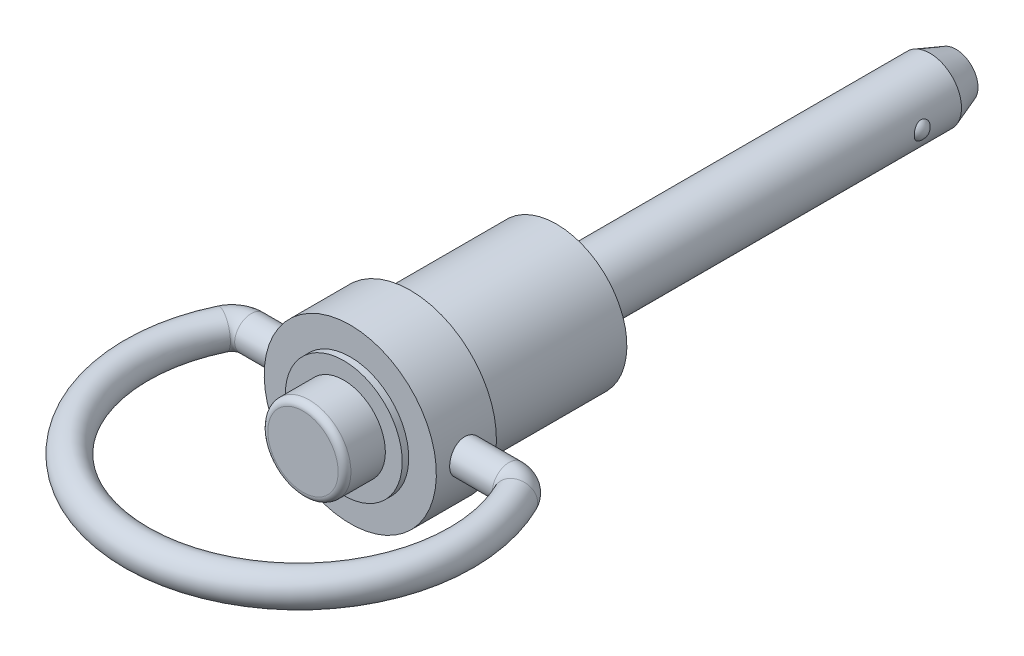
ISO-10303-21;
HEADER;
FILE_DESCRIPTION(('STEP AP214'),'2;1');
FILE_NAME('part.step','',(''),(''),'','','');
FILE_SCHEMA(('AUTOMOTIVE_DESIGN { 1 0 10303 214 1 1 1 1 }'));
ENDSEC;
DATA;
#1=APPLICATION_CONTEXT('core data for automotive mechanical design processes');
#2=APPLICATION_PROTOCOL_DEFINITION('international standard','automotive_design',2000,#1);
#3=PRODUCT_CONTEXT('',#1,'mechanical');
#4=PRODUCT('Part','Part','',(#3));
#5=PRODUCT_RELATED_PRODUCT_CATEGORY('part','',(#4));
#6=PRODUCT_DEFINITION_FORMATION('','',#4);
#7=PRODUCT_DEFINITION_CONTEXT('part definition',#1,'design');
#8=PRODUCT_DEFINITION('design','',#6,#7);
#9=PRODUCT_DEFINITION_SHAPE('','',#8);
#10=(LENGTH_UNIT() NAMED_UNIT(*) SI_UNIT(.MILLI.,.METRE.));
#11=(NAMED_UNIT(*) PLANE_ANGLE_UNIT() SI_UNIT($,.RADIAN.));
#12=(NAMED_UNIT(*) SI_UNIT($,.STERADIAN.) SOLID_ANGLE_UNIT());
#13=UNCERTAINTY_MEASURE_WITH_UNIT(LENGTH_MEASURE(1.E-05),#10,'distance_accuracy_value','');
#14=(GEOMETRIC_REPRESENTATION_CONTEXT(3) GLOBAL_UNCERTAINTY_ASSIGNED_CONTEXT((#13)) GLOBAL_UNIT_ASSIGNED_CONTEXT((#10,
#11,#12)) REPRESENTATION_CONTEXT('',''));
#15=CARTESIAN_POINT('',(0.,0.,0.));
#16=DIRECTION('',(0.,0.,1.));
#17=DIRECTION('',(1.,0.,0.));
#18=AXIS2_PLACEMENT_3D('',#15,#16,#17);
#19=CARTESIAN_POINT('',(0.,0.,20.828));
#20=DIRECTION('',(0.,0.,-1.));
#21=DIRECTION('',(0.,1.,0.));
#22=AXIS2_PLACEMENT_3D('',#19,#20,#21);
#23=CYLINDRICAL_SURFACE('',#22,3.2512);
#24=CARTESIAN_POINT('',(0.,0.,16.637));
#25=DIRECTION('',(0.,0.,-1.));
#26=DIRECTION('',(0.,1.,0.));
#27=AXIS2_PLACEMENT_3D('',#24,#25,#26);
#28=CIRCLE('',#27,3.2512);
#29=CARTESIAN_POINT('',(0.,3.2512,16.637));
#30=VERTEX_POINT('',#29);
#31=EDGE_CURVE('E35',#30,#30,#28,.T.);
#32=ORIENTED_EDGE('',*,*,#31,.F.);
#33=EDGE_LOOP('',(#32));
#34=FACE_BOUND('',#33,.T.);
#35=CARTESIAN_POINT('',(0.,0.,19.328));
#36=DIRECTION('',(0.,0.,1.));
#37=DIRECTION('',(1.,0.,0.));
#38=AXIS2_PLACEMENT_3D('',#35,#36,#37);
#39=CIRCLE('',#38,3.2512);
#40=CARTESIAN_POINT('',(3.2512,0.,19.328));
#41=VERTEX_POINT('',#40);
#42=EDGE_CURVE('E157',#41,#41,#39,.T.);
#43=ORIENTED_EDGE('',*,*,#42,.F.);
#44=EDGE_LOOP('',(#43));
#45=FACE_BOUND('',#44,.T.);
#46=ADVANCED_FACE('F13',(#34,#45),#23,.T.);
#47=CARTESIAN_POINT('',(4.572,0.,16.637));
#48=DIRECTION('',(0.,0.,1.));
#49=DIRECTION('',(0.,-1.,0.));
#50=AXIS2_PLACEMENT_3D('',#47,#48,#49);
#51=PLANE('',#50);
#52=ORIENTED_EDGE('',*,*,#31,.T.);
#53=EDGE_LOOP('',(#52));
#54=FACE_BOUND('',#53,.T.);
#55=CARTESIAN_POINT('',(0.,0.,16.637));
#56=DIRECTION('',(0.,0.,-1.));
#57=DIRECTION('',(0.,1.,0.));
#58=AXIS2_PLACEMENT_3D('',#55,#56,#57);
#59=CIRCLE('',#58,4.572);
#60=CARTESIAN_POINT('',(0.,4.572,16.637));
#61=VERTEX_POINT('',#60);
#62=EDGE_CURVE('E40',#61,#61,#59,.T.);
#63=ORIENTED_EDGE('',*,*,#62,.F.);
#64=EDGE_LOOP('',(#63));
#65=FACE_BOUND('',#64,.T.);
#66=ADVANCED_FACE('F81',(#54,#65),#51,.T.);
#67=CARTESIAN_POINT('',(0.,0.,0.));
#68=DIRECTION('',(0.,0.,-1.));
#69=DIRECTION('',(0.,1.,0.));
#70=AXIS2_PLACEMENT_3D('',#67,#68,#69);
#71=CYLINDRICAL_SURFACE('',#70,4.572);
#72=ORIENTED_EDGE('',*,*,#62,.T.);
#73=EDGE_LOOP('',(#72));
#74=FACE_BOUND('',#73,.T.);
#75=CARTESIAN_POINT('',(0.,0.,16.129));
#76=DIRECTION('',(0.,0.,-1.));
#77=DIRECTION('',(0.,1.,0.));
#78=AXIS2_PLACEMENT_3D('',#75,#76,#77);
#79=CIRCLE('',#78,4.572);
#80=CARTESIAN_POINT('',(0.,4.572,16.129));
#81=VERTEX_POINT('',#80);
#82=EDGE_CURVE('E43',#81,#81,#79,.T.);
#83=ORIENTED_EDGE('',*,*,#82,.F.);
#84=EDGE_LOOP('',(#83));
#85=FACE_BOUND('',#84,.T.);
#86=ADVANCED_FACE('F151',(#74,#85),#71,.T.);
#87=CARTESIAN_POINT('',(6.731,0.,16.129));
#88=DIRECTION('',(0.,0.,1.));
#89=DIRECTION('',(0.,-1.,0.));
#90=AXIS2_PLACEMENT_3D('',#87,#88,#89);
#91=PLANE('',#90);
#92=CARTESIAN_POINT('',(0.,0.,16.129));
#93=DIRECTION('',(0.,0.,-1.));
#94=DIRECTION('',(0.,1.,0.));
#95=AXIS2_PLACEMENT_3D('',#92,#93,#94);
#96=CIRCLE('',#95,6.731);
#97=CARTESIAN_POINT('',(0.,6.731,16.129));
#98=VERTEX_POINT('',#97);
#99=EDGE_CURVE('E46',#98,#98,#96,.T.);
#100=ORIENTED_EDGE('',*,*,#99,.F.);
#101=EDGE_LOOP('',(#100));
#102=FACE_BOUND('',#101,.T.);
#103=ORIENTED_EDGE('',*,*,#82,.T.);
#104=EDGE_LOOP('',(#103));
#105=FACE_BOUND('',#104,.T.);
#106=ADVANCED_FACE('F194',(#102,#105),#91,.T.);
#107=CARTESIAN_POINT('',(0.,0.,0.));
#108=DIRECTION('',(0.,0.,-1.));
#109=DIRECTION('',(0.,1.,0.));
#110=AXIS2_PLACEMENT_3D('',#107,#108,#109);
#111=CYLINDRICAL_SURFACE('',#110,6.731);
#112=CARTESIAN_POINT('',(0.,0.,11.43));
#113=DIRECTION('',(0.,0.,-1.));
#114=DIRECTION('',(0.,1.,0.));
#115=AXIS2_PLACEMENT_3D('',#112,#113,#114);
#116=CIRCLE('',#115,6.731);
#117=CARTESIAN_POINT('',(0.,6.731,11.43));
#118=VERTEX_POINT('',#117);
#119=EDGE_CURVE('E34',#118,#118,#116,.T.);
#120=ORIENTED_EDGE('',*,*,#119,.F.);
#121=EDGE_LOOP('',(#120));
#122=FACE_BOUND('',#121,.T.);
#123=ORIENTED_EDGE('',*,*,#99,.T.);
#124=EDGE_LOOP('',(#123));
#125=FACE_BOUND('',#124,.T.);
#126=CARTESIAN_POINT('',(-6.6051722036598,1.2954,13.7922));
#127=CARTESIAN_POINT('',(-6.60517361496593,1.2953972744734,13.864236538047));
#128=CARTESIAN_POINT('',(-6.60636346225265,1.2893707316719,13.9363080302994));
#129=CARTESIAN_POINT('',(-6.61098794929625,1.26544153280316,14.0784162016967));
#130=CARTESIAN_POINT('',(-6.61442445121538,1.24752902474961,14.1484511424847));
#131=CARTESIAN_POINT('',(-6.62313895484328,1.20040052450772,14.2844095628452));
#132=CARTESIAN_POINT('',(-6.62841519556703,1.17119533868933,14.3503369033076));
#133=CARTESIAN_POINT('',(-6.64021258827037,1.10233951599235,14.4763528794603));
#134=CARTESIAN_POINT('',(-6.64673365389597,1.06268960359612,14.5364419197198));
#135=CARTESIAN_POINT('',(-6.66038139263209,0.973516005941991,14.6498669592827));
#136=CARTESIAN_POINT('',(-6.66751428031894,0.923881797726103,14.7031153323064));
#137=CARTESIAN_POINT('',(-6.68152715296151,0.816387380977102,14.8005834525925));
#138=CARTESIAN_POINT('',(-6.68840712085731,0.75852661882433,14.8448025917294));
#139=CARTESIAN_POINT('',(-6.70120571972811,0.635644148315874,14.9232944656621));
#140=CARTESIAN_POINT('',(-6.70711617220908,0.570568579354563,14.9574843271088));
#141=CARTESIAN_POINT('',(-6.71724013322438,0.435464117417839,15.014412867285));
#142=CARTESIAN_POINT('',(-6.72145378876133,0.36543565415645,15.0371525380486));
#143=CARTESIAN_POINT('',(-6.72766549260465,0.223321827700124,15.0702635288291));
#144=CARTESIAN_POINT('',(-6.72968999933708,0.151272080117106,15.0807826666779));
#145=CARTESIAN_POINT('',(-6.73138656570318,0.00640388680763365,15.089614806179));
#146=CARTESIAN_POINT('',(-6.73105883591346,-0.0664144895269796,15.0879289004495));
#147=CARTESIAN_POINT('',(-6.72810846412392,-0.209738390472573,15.072511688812));
#148=CARTESIAN_POINT('',(-6.72551615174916,-0.280261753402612,15.0589395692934));
#149=CARTESIAN_POINT('',(-6.71836197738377,-0.418011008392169,15.0203872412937));
#150=CARTESIAN_POINT('',(-6.71380004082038,-0.485236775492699,14.9954066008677));
#151=CARTESIAN_POINT('',(-6.70316878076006,-0.614941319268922,14.9345963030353));
#152=CARTESIAN_POINT('',(-6.69709072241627,-0.677389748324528,14.8987035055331));
#153=CARTESIAN_POINT('',(-6.68409856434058,-0.795436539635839,14.8171343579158));
#154=CARTESIAN_POINT('',(-6.677184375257,-0.851034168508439,14.7714569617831));
#155=CARTESIAN_POINT('',(-6.66315320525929,-0.954744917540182,14.6707395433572));
#156=CARTESIAN_POINT('',(-6.65603475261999,-1.00272266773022,14.6155602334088));
#157=CARTESIAN_POINT('',(-6.64250376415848,-1.08876420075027,14.4978679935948));
#158=CARTESIAN_POINT('',(-6.63609123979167,-1.12682782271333,14.4353549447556));
#159=CARTESIAN_POINT('',(-6.62469571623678,-1.19200234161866,14.3045844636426));
#160=CARTESIAN_POINT('',(-6.61971540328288,-1.21909269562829,14.2363165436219));
#161=CARTESIAN_POINT('',(-6.61178862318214,-1.26138008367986,14.0960804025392));
#162=CARTESIAN_POINT('',(-6.60884191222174,-1.27657854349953,14.0241126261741));
#163=CARTESIAN_POINT('',(-6.60536444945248,-1.29445125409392,13.8797427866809));
#164=CARTESIAN_POINT('',(-6.60479610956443,-1.29732037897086,13.8073657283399));
#165=CARTESIAN_POINT('',(-6.60603903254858,-1.29097613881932,13.6631669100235));
#166=CARTESIAN_POINT('',(-6.60785017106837,-1.28176340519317,13.5913451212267));
#167=CARTESIAN_POINT('',(-6.61361289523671,-1.25168453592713,13.4509418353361));
#168=CARTESIAN_POINT('',(-6.61754556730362,-1.23092132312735,13.3823374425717));
#169=CARTESIAN_POINT('',(-6.62709183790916,-1.17844042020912,13.249581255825));
#170=CARTESIAN_POINT('',(-6.63270556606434,-1.14672188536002,13.1854298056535));
#171=CARTESIAN_POINT('',(-6.64506657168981,-1.07278507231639,13.0625442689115));
#172=CARTESIAN_POINT('',(-6.65182676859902,-1.03044414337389,13.0038853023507));
#173=CARTESIAN_POINT('',(-6.66568301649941,-0.936629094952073,12.8944341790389));
#174=CARTESIAN_POINT('',(-6.67277909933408,-0.885154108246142,12.8436427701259));
#175=CARTESIAN_POINT('',(-6.68662882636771,-0.773660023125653,12.7506362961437));
#176=CARTESIAN_POINT('',(-6.69337621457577,-0.713530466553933,12.7085525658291));
#177=CARTESIAN_POINT('',(-6.70566168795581,-0.586941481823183,12.6350847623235));
#178=CARTESIAN_POINT('',(-6.71119982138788,-0.520482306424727,12.6037002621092));
#179=CARTESIAN_POINT('',(-6.720415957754,-0.383476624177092,12.5527164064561));
#180=CARTESIAN_POINT('',(-6.72410395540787,-0.312954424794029,12.5330536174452));
#181=CARTESIAN_POINT('',(-6.72924701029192,-0.169530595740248,12.5058694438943));
#182=CARTESIAN_POINT('',(-6.7307023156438,-0.0966292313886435,12.4983467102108));
#183=CARTESIAN_POINT('',(-6.73121071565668,0.0482259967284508,12.4957052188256));
#184=CARTESIAN_POINT('',(-6.73030215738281,0.120176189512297,12.5003884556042));
#185=CARTESIAN_POINT('',(-6.72626496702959,0.262244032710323,12.5215909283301));
#186=CARTESIAN_POINT('',(-6.72313635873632,0.332361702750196,12.5381100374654));
#187=CARTESIAN_POINT('',(-6.71501101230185,0.468662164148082,12.5824301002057));
#188=CARTESIAN_POINT('',(-6.710017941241,0.534852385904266,12.6102089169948));
#189=CARTESIAN_POINT('',(-6.69870305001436,0.661661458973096,12.6762356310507));
#190=CARTESIAN_POINT('',(-6.69238113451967,0.722279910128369,12.7144842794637));
#191=CARTESIAN_POINT('',(-6.6789853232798,0.837208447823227,12.8010411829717));
#192=CARTESIAN_POINT('',(-6.67190155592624,0.891410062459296,12.8494919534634));
#193=CARTESIAN_POINT('',(-6.65784127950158,0.990982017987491,12.95478313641));
#194=CARTESIAN_POINT('',(-6.65086479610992,1.03635027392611,13.0116255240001));
#195=CARTESIAN_POINT('',(-6.63773378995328,1.1173887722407,13.1327559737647));
#196=CARTESIAN_POINT('',(-6.63158802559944,1.15295925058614,13.1971117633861));
#197=CARTESIAN_POINT('',(-6.62092027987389,1.21272619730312,13.3309847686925));
#198=CARTESIAN_POINT('',(-6.61639678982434,1.23693323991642,13.4004971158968));
#199=CARTESIAN_POINT('',(-6.61041337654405,1.26845390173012,13.5238636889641));
#200=CARTESIAN_POINT('',(-6.60845980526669,1.27854107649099,13.57700269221));
#201=CARTESIAN_POINT('',(-6.60583870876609,1.29201504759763,13.6841545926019));
#202=CARTESIAN_POINT('',(-6.60517114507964,1.29540204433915,13.7381674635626));
#203=CARTESIAN_POINT('',(-6.6051722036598,1.2954,13.7922));
#204=B_SPLINE_CURVE_WITH_KNOTS('',3,(#126,#127,#128,#129,#130,#131,#132,#133,#134,#135,#136,
#137,#138,#139,#140,#141,#142,#143,#144,#145,#146,#147,#148,#149,#150,#151,#152,#153,#154,#155,
#156,#157,#158,#159,#160,#161,#162,#163,#164,#165,#166,#167,#168,#169,#170,#171,#172,#173,#174,
#175,#176,#177,#178,#179,#180,#181,#182,#183,#184,#185,#186,#187,#188,#189,#190,#191,#192,#193,
#194,#195,#196,#197,#198,#199,#200,#201,#202,#203),.UNSPECIFIED.,.T.,.F.,(4,2,2,2,2,2,2,2,2,2,2,
2,2,2,2,2,2,2,2,2,2,2,2,2,2,2,2,2,2,2,2,2,2,2,2,2,2,2,4),(0.,0.215911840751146,
0.432002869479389,0.647887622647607,0.863757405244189,1.08216318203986,1.30058366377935,
1.52076118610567,1.74091962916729,1.95838638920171,2.1758336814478,2.39041258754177,
2.60499961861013,2.82085272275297,3.0367289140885,3.25609136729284,3.47545737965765,
3.69523218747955,3.91498064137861,4.13124273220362,4.34749352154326,4.56184753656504,
4.7762180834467,4.99318797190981,5.21017847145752,5.43023526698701,5.65028327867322,
5.86912939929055,6.08795119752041,6.30324544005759,6.51853737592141,6.73340808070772,
6.94829420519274,7.16640910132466,7.38457541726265,7.60488731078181,7.82499378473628,
7.98694789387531,8.14889715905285),.UNSPECIFIED.);
#205=CARTESIAN_POINT('',(-6.6051722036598,1.2954,13.7922));
#206=VERTEX_POINT('',#205);
#207=EDGE_CURVE('E28',#206,#206,#204,.T.);
#208=ORIENTED_EDGE('',*,*,#207,.T.);
#209=EDGE_LOOP('',(#208));
#210=FACE_BOUND('',#209,.T.);
#211=CARTESIAN_POINT('',(6.6051722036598,1.2954,13.7922));
#212=CARTESIAN_POINT('',(6.60517361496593,1.2953972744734,13.720163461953));
#213=CARTESIAN_POINT('',(6.60636346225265,1.2893707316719,13.6480919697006));
#214=CARTESIAN_POINT('',(6.61098794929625,1.26544153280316,13.5059837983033));
#215=CARTESIAN_POINT('',(6.61442445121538,1.24752902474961,13.4359488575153));
#216=CARTESIAN_POINT('',(6.62313895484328,1.20040052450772,13.2999904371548));
#217=CARTESIAN_POINT('',(6.62841519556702,1.17119533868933,13.2340630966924));
#218=CARTESIAN_POINT('',(6.64021258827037,1.10233951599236,13.1080471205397));
#219=CARTESIAN_POINT('',(6.64673365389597,1.06268960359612,13.0479580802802));
#220=CARTESIAN_POINT('',(6.66038139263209,0.973516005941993,12.9345330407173));
#221=CARTESIAN_POINT('',(6.66751428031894,0.923881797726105,12.8812846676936));
#222=CARTESIAN_POINT('',(6.68152715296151,0.816387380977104,12.7838165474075));
#223=CARTESIAN_POINT('',(6.68840712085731,0.758526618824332,12.7395974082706));
#224=CARTESIAN_POINT('',(6.70120571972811,0.635644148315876,12.6611055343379));
#225=CARTESIAN_POINT('',(6.70711617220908,0.570568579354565,12.6269156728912));
#226=CARTESIAN_POINT('',(6.71724013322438,0.435464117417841,12.569987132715));
#227=CARTESIAN_POINT('',(6.72145378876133,0.365435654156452,12.5472474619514));
#228=CARTESIAN_POINT('',(6.72766549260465,0.223321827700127,12.5141364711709));
#229=CARTESIAN_POINT('',(6.72968999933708,0.151272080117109,12.5036173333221));
#230=CARTESIAN_POINT('',(6.73138656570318,0.0064038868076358,12.494785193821));
#231=CARTESIAN_POINT('',(6.73105883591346,-0.0664144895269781,12.4964710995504));
#232=CARTESIAN_POINT('',(6.72810846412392,-0.209738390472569,12.511888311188));
#233=CARTESIAN_POINT('',(6.72551615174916,-0.280261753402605,12.5254604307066));
#234=CARTESIAN_POINT('',(6.71836197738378,-0.418011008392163,12.5640127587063));
#235=CARTESIAN_POINT('',(6.71380004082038,-0.485236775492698,12.5889933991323));
#236=CARTESIAN_POINT('',(6.70316878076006,-0.614941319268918,12.6498036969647));
#237=CARTESIAN_POINT('',(6.69709072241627,-0.677389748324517,12.6856964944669));
#238=CARTESIAN_POINT('',(6.68409856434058,-0.795436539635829,12.7672656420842));
#239=CARTESIAN_POINT('',(6.677184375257,-0.851034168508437,12.8129430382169));
#240=CARTESIAN_POINT('',(6.66315320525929,-0.954744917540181,12.9136604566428));
#241=CARTESIAN_POINT('',(6.65603475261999,-1.00272266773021,12.9688397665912));
#242=CARTESIAN_POINT('',(6.64250376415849,-1.08876420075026,13.0865320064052));
#243=CARTESIAN_POINT('',(6.63609123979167,-1.12682782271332,13.1490450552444));
#244=CARTESIAN_POINT('',(6.62469571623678,-1.19200234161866,13.2798155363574));
#245=CARTESIAN_POINT('',(6.61971540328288,-1.21909269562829,13.3480834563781));
#246=CARTESIAN_POINT('',(6.61178862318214,-1.26138008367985,13.4883195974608));
#247=CARTESIAN_POINT('',(6.60884191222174,-1.27657854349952,13.5602873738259));
#248=CARTESIAN_POINT('',(6.60536444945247,-1.29445125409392,13.7046572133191));
#249=CARTESIAN_POINT('',(6.60479610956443,-1.29732037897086,13.7770342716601));
#250=CARTESIAN_POINT('',(6.60603903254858,-1.29097613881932,13.9212330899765));
#251=CARTESIAN_POINT('',(6.60785017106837,-1.28176340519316,13.9930548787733));
#252=CARTESIAN_POINT('',(6.61361289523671,-1.25168453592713,14.1334581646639));
#253=CARTESIAN_POINT('',(6.61754556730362,-1.23092132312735,14.2020625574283));
#254=CARTESIAN_POINT('',(6.62709183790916,-1.17844042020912,14.334818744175));
#255=CARTESIAN_POINT('',(6.63270556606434,-1.14672188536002,14.3989701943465));
#256=CARTESIAN_POINT('',(6.64506657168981,-1.07278507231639,14.5218557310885));
#257=CARTESIAN_POINT('',(6.65182676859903,-1.03044414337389,14.5805146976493));
#258=CARTESIAN_POINT('',(6.66568301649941,-0.93662909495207,14.6899658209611));
#259=CARTESIAN_POINT('',(6.67277909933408,-0.88515410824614,14.7407572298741));
#260=CARTESIAN_POINT('',(6.68662882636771,-0.773660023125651,14.8337637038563));
#261=CARTESIAN_POINT('',(6.69337621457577,-0.713530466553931,14.8758474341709));
#262=CARTESIAN_POINT('',(6.70566168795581,-0.58694148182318,14.9493152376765));
#263=CARTESIAN_POINT('',(6.71119982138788,-0.520482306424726,14.9806997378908));
#264=CARTESIAN_POINT('',(6.72041595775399,-0.38347662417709,15.0316835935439));
#265=CARTESIAN_POINT('',(6.72410395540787,-0.312954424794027,15.0513463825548));
#266=CARTESIAN_POINT('',(6.72924701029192,-0.169530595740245,15.0785305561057));
#267=CARTESIAN_POINT('',(6.7307023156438,-0.0966292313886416,15.0860532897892));
#268=CARTESIAN_POINT('',(6.73121071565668,0.0482259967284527,15.0886947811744));
#269=CARTESIAN_POINT('',(6.73030215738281,0.120176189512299,15.0840115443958));
#270=CARTESIAN_POINT('',(6.72626496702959,0.262244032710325,15.0628090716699));
#271=CARTESIAN_POINT('',(6.72313635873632,0.332361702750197,15.0462899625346));
#272=CARTESIAN_POINT('',(6.71501101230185,0.468662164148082,15.0019698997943));
#273=CARTESIAN_POINT('',(6.710017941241,0.534852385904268,14.9741910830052));
#274=CARTESIAN_POINT('',(6.69870305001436,0.661661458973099,14.9081643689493));
#275=CARTESIAN_POINT('',(6.69238113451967,0.722279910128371,14.8699157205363));
#276=CARTESIAN_POINT('',(6.6789853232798,0.837208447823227,14.7833588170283));
#277=CARTESIAN_POINT('',(6.67190155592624,0.891410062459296,14.7349080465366));
#278=CARTESIAN_POINT('',(6.65784127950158,0.990982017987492,14.62961686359));
#279=CARTESIAN_POINT('',(6.65086479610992,1.03635027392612,14.5727744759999));
#280=CARTESIAN_POINT('',(6.63773378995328,1.1173887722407,14.4516440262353));
#281=CARTESIAN_POINT('',(6.63158802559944,1.15295925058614,14.3872882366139));
#282=CARTESIAN_POINT('',(6.62092027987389,1.21272619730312,14.2534152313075));
#283=CARTESIAN_POINT('',(6.61639678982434,1.23693323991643,14.1839028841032));
#284=CARTESIAN_POINT('',(6.61041337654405,1.26845390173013,14.0605363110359));
#285=CARTESIAN_POINT('',(6.60845980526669,1.27854107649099,14.00739730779));
#286=CARTESIAN_POINT('',(6.60583870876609,1.29201504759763,13.9002454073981));
#287=CARTESIAN_POINT('',(6.60517114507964,1.29540204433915,13.8462325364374));
#288=CARTESIAN_POINT('',(6.6051722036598,1.2954,13.7922));
#289=B_SPLINE_CURVE_WITH_KNOTS('',3,(#211,#212,#213,#214,#215,#216,#217,#218,#219,#220,#221,
#222,#223,#224,#225,#226,#227,#228,#229,#230,#231,#232,#233,#234,#235,#236,#237,#238,#239,#240,
#241,#242,#243,#244,#245,#246,#247,#248,#249,#250,#251,#252,#253,#254,#255,#256,#257,#258,#259,
#260,#261,#262,#263,#264,#265,#266,#267,#268,#269,#270,#271,#272,#273,#274,#275,#276,#277,#278,
#279,#280,#281,#282,#283,#284,#285,#286,#287,#288),.UNSPECIFIED.,.T.,.F.,(4,2,2,2,2,2,2,2,2,2,2,
2,2,2,2,2,2,2,2,2,2,2,2,2,2,2,2,2,2,2,2,2,2,2,2,2,2,2,4),(0.,0.215911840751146,
0.432002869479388,0.647887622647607,0.863757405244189,1.08216318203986,1.30058366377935,
1.52076118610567,1.74091962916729,1.95838638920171,2.1758336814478,2.39041258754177,
2.60499961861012,2.82085272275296,3.0367289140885,3.25609136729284,3.47545737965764,
3.69523218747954,3.91498064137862,4.13124273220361,4.34749352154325,4.56184753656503,
4.77621808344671,4.99318797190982,5.21017847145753,5.43023526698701,5.65028327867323,
5.86912939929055,6.08795119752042,6.30324544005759,6.51853737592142,6.73340808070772,
6.94829420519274,7.16640910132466,7.38457541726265,7.60488731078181,7.82499378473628,
7.98694789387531,8.14889715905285),.UNSPECIFIED.);
#290=CARTESIAN_POINT('',(6.6051722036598,1.2954,13.7922));
#291=VERTEX_POINT('',#290);
#292=EDGE_CURVE('E24',#291,#291,#289,.T.);
#293=ORIENTED_EDGE('',*,*,#292,.T.);
#294=EDGE_LOOP('',(#293));
#295=FACE_BOUND('',#294,.T.);
#296=ADVANCED_FACE('F143',(#122,#125,#210,#295),#111,.T.);
#297=CARTESIAN_POINT('',(5.7785,0.,11.43));
#298=DIRECTION('',(0.,0.,-1.));
#299=DIRECTION('',(0.,1.,0.));
#300=AXIS2_PLACEMENT_3D('',#297,#298,#299);
#301=PLANE('',#300);
#302=CARTESIAN_POINT('',(0.,0.,11.43));
#303=DIRECTION('',(0.,0.,-1.));
#304=DIRECTION('',(0.,1.,0.));
#305=AXIS2_PLACEMENT_3D('',#302,#303,#304);
#306=CIRCLE('',#305,5.9);
#307=CARTESIAN_POINT('',(0.,5.9,11.43));
#308=VERTEX_POINT('',#307);
#309=EDGE_CURVE('E20',#308,#308,#306,.F.);
#310=ORIENTED_EDGE('',*,*,#309,.T.);
#311=EDGE_LOOP('',(#310));
#312=FACE_BOUND('',#311,.T.);
#313=ORIENTED_EDGE('',*,*,#119,.T.);
#314=EDGE_LOOP('',(#313));
#315=FACE_BOUND('',#314,.T.);
#316=ADVANCED_FACE('F137',(#312,#315),#301,.T.);
#317=CARTESIAN_POINT('',(10.0803124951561,0.,15.3162));
#318=DIRECTION('',(0.,1.,0.));
#319=DIRECTION('',(-1.,0.,0.));
#320=AXIS2_PLACEMENT_3D('',#317,#318,#319);
#321=TOROIDAL_SURFACE('',#320,1.524,1.2954);
#322=CARTESIAN_POINT('',(11.4549005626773,0.,14.658109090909));
#323=DIRECTION('',(-0.431818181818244,0.,-0.901960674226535));
#324=DIRECTION('',(0.901960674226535,0.,-0.431818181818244));
#325=AXIS2_PLACEMENT_3D('',#322,#323,#324);
#326=CIRCLE('',#325,1.2954);
#327=CARTESIAN_POINT('',(12.6233004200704,0.,14.0987318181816));
#328=VERTEX_POINT('',#327);
#329=EDGE_CURVE('E51',#328,#328,#326,.T.);
#330=ORIENTED_EDGE('',*,*,#329,.T.);
#331=EDGE_LOOP('',(#330));
#332=FACE_BOUND('',#331,.T.);
#333=CARTESIAN_POINT('',(10.0803124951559,0.,13.7922));
#334=DIRECTION('',(1.,0.,0.));
#335=DIRECTION('',(0.,1.,0.));
#336=AXIS2_PLACEMENT_3D('',#333,#334,#335);
#337=CIRCLE('',#336,1.2954);
#338=CARTESIAN_POINT('',(10.0803124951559,1.2954,13.7922));
#339=VERTEX_POINT('',#338);
#340=EDGE_CURVE('E39',#339,#339,#337,.F.);
#341=ORIENTED_EDGE('',*,*,#340,.F.);
#342=EDGE_LOOP('',(#341));
#343=FACE_BOUND('',#342,.T.);
#344=ADVANCED_FACE('F79',(#332,#343),#321,.T.);
#345=CARTESIAN_POINT('',(-10.0803124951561,0.,13.7922));
#346=DIRECTION('',(1.,0.,0.));
#347=DIRECTION('',(0.,1.,0.));
#348=AXIS2_PLACEMENT_3D('',#345,#346,#347);
#349=CYLINDRICAL_SURFACE('',#348,1.2954);
#350=ORIENTED_EDGE('',*,*,#292,.F.);
#351=EDGE_LOOP('',(#350));
#352=FACE_BOUND('',#351,.T.);
#353=ORIENTED_EDGE('',*,*,#340,.T.);
#354=EDGE_LOOP('',(#353));
#355=FACE_BOUND('',#354,.T.);
#356=ADVANCED_FACE('F75',(#352,#355),#349,.T.);
#357=CARTESIAN_POINT('',(0.,0.,20.1422));
#358=DIRECTION('',(0.,1.,0.));
#359=DIRECTION('',(-1.,0.,0.));
#360=AXIS2_PLACEMENT_3D('',#357,#358,#359);
#361=TOROIDAL_SURFACE('',#360,12.7,1.2954);
#362=CARTESIAN_POINT('',(-11.4549005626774,0.,14.6581090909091));
#363=DIRECTION('',(-0.43181818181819,0.,0.901960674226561));
#364=DIRECTION('',(-0.901960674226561,0.,-0.43181818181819));
#365=AXIS2_PLACEMENT_3D('',#362,#363,#364);
#366=CIRCLE('',#365,1.2954);
#367=CARTESIAN_POINT('',(-12.6233004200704,0.,14.0987318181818));
#368=VERTEX_POINT('',#367);
#369=EDGE_CURVE('E54',#368,#368,#366,.F.);
#370=ORIENTED_EDGE('',*,*,#369,.F.);
#371=EDGE_LOOP('',(#370));
#372=FACE_BOUND('',#371,.T.);
#373=ORIENTED_EDGE('',*,*,#329,.F.);
#374=EDGE_LOOP('',(#373));
#375=FACE_BOUND('',#374,.T.);
#376=ADVANCED_FACE('F72',(#372,#375),#361,.T.);
#377=CARTESIAN_POINT('',(-10.0803124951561,0.,15.3162));
#378=DIRECTION('',(0.,1.,0.));
#379=DIRECTION('',(-1.,0.,0.));
#380=AXIS2_PLACEMENT_3D('',#377,#378,#379);
#381=TOROIDAL_SURFACE('',#380,1.524,1.2954);
#382=CARTESIAN_POINT('',(-10.0803124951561,0.,13.7922));
#383=DIRECTION('',(1.,0.,0.));
#384=DIRECTION('',(0.,1.,0.));
#385=AXIS2_PLACEMENT_3D('',#382,#383,#384);
#386=CIRCLE('',#385,1.2954);
#387=CARTESIAN_POINT('',(-10.0803124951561,1.2954,13.7922));
#388=VERTEX_POINT('',#387);
#389=EDGE_CURVE('E38',#388,#388,#386,.T.);
#390=ORIENTED_EDGE('',*,*,#389,.F.);
#391=EDGE_LOOP('',(#390));
#392=FACE_BOUND('',#391,.T.);
#393=ORIENTED_EDGE('',*,*,#369,.T.);
#394=EDGE_LOOP('',(#393));
#395=FACE_BOUND('',#394,.T.);
#396=ADVANCED_FACE('F67',(#392,#395),#381,.T.);
#397=CARTESIAN_POINT('',(-10.0803124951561,0.,13.7922));
#398=DIRECTION('',(1.,0.,0.));
#399=DIRECTION('',(0.,1.,0.));
#400=AXIS2_PLACEMENT_3D('',#397,#398,#399);
#401=CYLINDRICAL_SURFACE('',#400,1.2954);
#402=ORIENTED_EDGE('',*,*,#207,.F.);
#403=EDGE_LOOP('',(#402));
#404=FACE_BOUND('',#403,.T.);
#405=ORIENTED_EDGE('',*,*,#389,.T.);
#406=EDGE_LOOP('',(#405));
#407=FACE_BOUND('',#406,.T.);
#408=ADVANCED_FACE('F71',(#404,#407),#401,.T.);
#409=CARTESIAN_POINT('',(0.,0.,19.328));
#410=DIRECTION('',(0.,0.,1.));
#411=DIRECTION('',(1.,0.,0.));
#412=AXIS2_PLACEMENT_3D('',#409,#410,#411);
#413=TOROIDAL_SURFACE('',#412,2.7512,0.5);
#414=CARTESIAN_POINT('',(0.,0.,19.828));
#415=DIRECTION('',(0.,0.,1.));
#416=DIRECTION('',(1.,0.,0.));
#417=AXIS2_PLACEMENT_3D('',#414,#415,#416);
#418=CIRCLE('',#417,2.7512);
#419=CARTESIAN_POINT('',(2.7512,0.,19.828));
#420=VERTEX_POINT('',#419);
#421=EDGE_CURVE('E159',#420,#420,#418,.T.);
#422=ORIENTED_EDGE('',*,*,#421,.F.);
#423=EDGE_LOOP('',(#422));
#424=FACE_BOUND('',#423,.T.);
#425=ORIENTED_EDGE('',*,*,#42,.T.);
#426=EDGE_LOOP('',(#425));
#427=FACE_BOUND('',#426,.T.);
#428=ADVANCED_FACE('F98',(#424,#427),#413,.T.);
#429=CARTESIAN_POINT('',(0.,0.,19.828));
#430=DIRECTION('',(0.,0.,-1.));
#431=DIRECTION('',(-1.,0.,0.));
#432=AXIS2_PLACEMENT_3D('',#429,#430,#431);
#433=PLANE('',#432);
#434=ORIENTED_EDGE('',*,*,#421,.T.);
#435=EDGE_LOOP('',(#434));
#436=FACE_BOUND('',#435,.T.);
#437=ADVANCED_FACE('F171',(#436),#433,.F.);
#438=CARTESIAN_POINT('',(0.,0.,46.2584441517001));
#439=DIRECTION('',(0.,0.,-1.));
#440=DIRECTION('',(0.,1.,0.));
#441=AXIS2_PLACEMENT_3D('',#438,#439,#440);
#442=CYLINDRICAL_SURFACE('',#441,5.5);
#443=CARTESIAN_POINT('',(0.,0.,11.03));
#444=DIRECTION('',(0.,0.,-1.));
#445=DIRECTION('',(0.,1.,0.));
#446=AXIS2_PLACEMENT_3D('',#443,#444,#445);
#447=CIRCLE('',#446,5.5);
#448=CARTESIAN_POINT('',(0.,5.5,11.03));
#449=VERTEX_POINT('',#448);
#450=EDGE_CURVE('E8',#449,#449,#447,.T.);
#451=ORIENTED_EDGE('',*,*,#450,.T.);
#452=EDGE_LOOP('',(#451));
#453=FACE_BOUND('',#452,.T.);
#454=CARTESIAN_POINT('',(0.,0.,0.));
#455=DIRECTION('',(0.,0.,-1.));
#456=DIRECTION('',(0.,1.,0.));
#457=AXIS2_PLACEMENT_3D('',#454,#455,#456);
#458=CIRCLE('',#457,5.5);
#459=CARTESIAN_POINT('',(0.,5.5,0.));
#460=VERTEX_POINT('',#459);
#461=EDGE_CURVE('E162',#460,#460,#458,.T.);
#462=ORIENTED_EDGE('',*,*,#461,.F.);
#463=EDGE_LOOP('',(#462));
#464=FACE_BOUND('',#463,.T.);
#465=ADVANCED_FACE('F105',(#453,#464),#442,.T.);
#466=CARTESIAN_POINT('',(1.73119748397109,0.,-31.2306));
#467=DIRECTION('',(0.,0.,1.));
#468=DIRECTION('',(0.,-1.,0.));
#469=AXIS2_PLACEMENT_3D('',#466,#467,#468);
#470=PLANE('',#469);
#471=CARTESIAN_POINT('',(0.,0.,-31.2306000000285));
#472=DIRECTION('',(0.,0.,1.));
#473=DIRECTION('',(-1.,0.,0.));
#474=AXIS2_PLACEMENT_3D('',#471,#472,#473);
#475=CIRCLE('',#474,1.73119748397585);
#476=CARTESIAN_POINT('',(-1.73119748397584,0.,-31.2306000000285));
#477=VERTEX_POINT('',#476);
#478=EDGE_CURVE('E124',#477,#477,#475,.T.);
#479=ORIENTED_EDGE('',*,*,#478,.F.);
#480=EDGE_LOOP('',(#479));
#481=FACE_BOUND('',#480,.T.);
#482=ADVANCED_FACE('F100',(#481),#470,.F.);
#483=CARTESIAN_POINT('',(1.97739,0.,-26.1252));
#484=DIRECTION('',(0.,0.,1.));
#485=DIRECTION('',(1.,0.,0.));
#486=AXIS2_PLACEMENT_3D('',#483,#484,#485);
#487=SPHERICAL_SURFACE('',#486,0.79375);
#488=CARTESIAN_POINT('',(2.470785,0.,-25.5034279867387));
#489=CARTESIAN_POINT('',(2.47078450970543,0.0407779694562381,-25.5034284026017));
#490=CARTESIAN_POINT('',(2.46976664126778,0.081562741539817,-25.5066414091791));
#491=CARTESIAN_POINT('',(2.46579298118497,0.162087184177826,-25.5194782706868));
#492=CARTESIAN_POINT('',(2.46283382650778,0.201824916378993,-25.5291132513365));
#493=CARTESIAN_POINT('',(2.45527981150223,0.27908288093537,-25.5547224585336));
#494=CARTESIAN_POINT('',(2.4506836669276,0.31660134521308,-25.5707016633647));
#495=CARTESIAN_POINT('',(2.44036557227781,0.388204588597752,-25.6088086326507));
#496=CARTESIAN_POINT('',(2.43464406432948,0.422290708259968,-25.6309339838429));
#497=CARTESIAN_POINT('',(2.42293774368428,0.484910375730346,-25.6802681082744));
#498=CARTESIAN_POINT('',(2.41696529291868,0.513575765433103,-25.7073117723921));
#499=CARTESIAN_POINT('',(2.40537490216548,0.565381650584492,-25.7663344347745));
#500=CARTESIAN_POINT('',(2.39975676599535,0.588525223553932,-25.7983106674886));
#501=CARTESIAN_POINT('',(2.39013715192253,0.626395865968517,-25.8632598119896));
#502=CARTESIAN_POINT('',(2.3860358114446,0.641692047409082,-25.8958854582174));
#503=CARTESIAN_POINT('',(2.37935105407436,0.666054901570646,-25.9635277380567));
#504=CARTESIAN_POINT('',(2.37676637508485,0.675126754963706,-25.9985423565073));
#505=CARTESIAN_POINT('',(2.37365169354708,0.685991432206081,-26.0661524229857));
#506=CARTESIAN_POINT('',(2.3729415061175,0.688423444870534,-26.0986379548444));
#507=CARTESIAN_POINT('',(2.3731355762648,0.687754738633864,-26.1635427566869));
#508=CARTESIAN_POINT('',(2.37403937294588,0.684655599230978,-26.1959620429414));
#509=CARTESIAN_POINT('',(2.37727684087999,0.673323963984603,-26.258349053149));
#510=CARTESIAN_POINT('',(2.37954686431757,0.665319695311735,-26.2883621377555));
#511=CARTESIAN_POINT('',(2.38521427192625,0.644705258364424,-26.3466434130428));
#512=CARTESIAN_POINT('',(2.38861178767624,0.632094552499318,-26.374911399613));
#513=CARTESIAN_POINT('',(2.39633342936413,0.602171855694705,-26.4300782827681));
#514=CARTESIAN_POINT('',(2.40068724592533,0.584702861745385,-26.4568875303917));
#515=CARTESIAN_POINT('',(2.40981924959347,0.545846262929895,-26.5074782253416));
#516=CARTESIAN_POINT('',(2.41459823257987,0.524451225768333,-26.5312537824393));
#517=CARTESIAN_POINT('',(2.42457469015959,0.476310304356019,-26.5773361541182));
#518=CARTESIAN_POINT('',(2.42977140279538,0.449257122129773,-26.5993219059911));
#519=CARTESIAN_POINT('',(2.43965148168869,0.392072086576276,-26.6388785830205));
#520=CARTESIAN_POINT('',(2.44433535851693,0.361943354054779,-26.6564539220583));
#521=CARTESIAN_POINT('',(2.45319212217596,0.296347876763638,-26.6884994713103));
#522=CARTESIAN_POINT('',(2.45727382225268,0.260646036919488,-26.7025143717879));
#523=CARTESIAN_POINT('',(2.46393856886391,0.187441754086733,-26.7249081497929));
#524=CARTESIAN_POINT('',(2.46652349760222,0.149941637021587,-26.7332941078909));
#525=CARTESIAN_POINT('',(2.46992655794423,0.0749487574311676,-26.7442592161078));
#526=CARTESIAN_POINT('',(2.47078545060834,0.0374772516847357,-26.7469723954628));
#527=CARTESIAN_POINT('',(2.47078450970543,-0.0407779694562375,-26.7469715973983));
#528=CARTESIAN_POINT('',(2.46976664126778,-0.0815627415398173,-26.7437585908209));
#529=CARTESIAN_POINT('',(2.46579298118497,-0.162087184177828,-26.7309217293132));
#530=CARTESIAN_POINT('',(2.46283382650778,-0.201824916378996,-26.7212867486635));
#531=CARTESIAN_POINT('',(2.45527981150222,-0.279082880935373,-26.6956775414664));
#532=CARTESIAN_POINT('',(2.45068366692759,-0.316601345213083,-26.6796983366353));
#533=CARTESIAN_POINT('',(2.44036557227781,-0.388204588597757,-26.6415913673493));
#534=CARTESIAN_POINT('',(2.43464406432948,-0.422290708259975,-26.6194660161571));
#535=CARTESIAN_POINT('',(2.42293774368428,-0.484910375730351,-26.5701318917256));
#536=CARTESIAN_POINT('',(2.41696529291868,-0.513575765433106,-26.5430882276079));
#537=CARTESIAN_POINT('',(2.40537490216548,-0.565381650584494,-26.4840655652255));
#538=CARTESIAN_POINT('',(2.39975676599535,-0.588525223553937,-26.4520893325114));
#539=CARTESIAN_POINT('',(2.39013715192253,-0.62639586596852,-26.3871401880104));
#540=CARTESIAN_POINT('',(2.3860358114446,-0.641692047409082,-26.3545145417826));
#541=CARTESIAN_POINT('',(2.37935105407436,-0.666054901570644,-26.2868722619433));
#542=CARTESIAN_POINT('',(2.37676637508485,-0.675126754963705,-26.2518576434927));
#543=CARTESIAN_POINT('',(2.37365169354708,-0.68599143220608,-26.1842475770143));
#544=CARTESIAN_POINT('',(2.3729415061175,-0.688423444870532,-26.1517620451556));
#545=CARTESIAN_POINT('',(2.3731355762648,-0.687754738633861,-26.0868572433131));
#546=CARTESIAN_POINT('',(2.37403937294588,-0.684655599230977,-26.0544379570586));
#547=CARTESIAN_POINT('',(2.37727684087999,-0.673323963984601,-25.992050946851));
#548=CARTESIAN_POINT('',(2.37954686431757,-0.665319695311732,-25.9620378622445));
#549=CARTESIAN_POINT('',(2.38521427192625,-0.644705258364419,-25.9037565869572));
#550=CARTESIAN_POINT('',(2.38861178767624,-0.632094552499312,-25.875488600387));
#551=CARTESIAN_POINT('',(2.39633342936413,-0.6021718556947,-25.8203217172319));
#552=CARTESIAN_POINT('',(2.40068724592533,-0.584702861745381,-25.7935124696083));
#553=CARTESIAN_POINT('',(2.40981924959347,-0.545846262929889,-25.7429217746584));
#554=CARTESIAN_POINT('',(2.41459823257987,-0.524451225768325,-25.7191462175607));
#555=CARTESIAN_POINT('',(2.42457469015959,-0.476310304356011,-25.6730638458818));
#556=CARTESIAN_POINT('',(2.42977140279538,-0.449257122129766,-25.6510780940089));
#557=CARTESIAN_POINT('',(2.43965148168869,-0.392072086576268,-25.6115214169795));
#558=CARTESIAN_POINT('',(2.44433535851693,-0.361943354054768,-25.5939460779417));
#559=CARTESIAN_POINT('',(2.45319212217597,-0.296347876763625,-25.5619005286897));
#560=CARTESIAN_POINT('',(2.45727382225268,-0.260646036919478,-25.5478856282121));
#561=CARTESIAN_POINT('',(2.46393856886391,-0.187441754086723,-25.5254918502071));
#562=CARTESIAN_POINT('',(2.46652349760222,-0.149941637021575,-25.5171058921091));
#563=CARTESIAN_POINT('',(2.46992655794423,-0.0749487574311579,-25.5061407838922));
#564=CARTESIAN_POINT('',(2.47078545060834,-0.03747725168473,-25.5034276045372));
#565=CARTESIAN_POINT('',(2.470785,0.,-25.5034279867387));
#566=B_SPLINE_CURVE_WITH_KNOTS('',3,(#488,#489,#490,#491,#492,#493,#494,#495,#496,#497,#498,
#499,#500,#501,#502,#503,#504,#505,#506,#507,#508,#509,#510,#511,#512,#513,#514,#515,#516,#517,
#518,#519,#520,#521,#522,#523,#524,#525,#526,#527,#528,#529,#530,#531,#532,#533,#534,#535,#536,
#537,#538,#539,#540,#541,#542,#543,#544,#545,#546,#547,#548,#549,#550,#551,#552,#553,#554,#555,
#556,#557,#558,#559,#560,#561,#562,#563,#564,#565),.UNSPECIFIED.,.T.,.F.,(4,2,2,2,2,2,2,2,2,2,2,
2,2,2,2,2,2,2,2,2,2,2,2,2,2,2,2,2,2,2,2,2,2,2,2,2,2,2,4),(0.,0.122206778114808,
0.244625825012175,0.367141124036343,0.489608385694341,0.608541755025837,0.727408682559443,
0.835603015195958,0.943707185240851,1.04096126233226,1.13818757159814,1.23120142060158,
1.32422612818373,1.42070064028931,1.51735970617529,1.62265560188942,1.72784569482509,
1.84305665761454,1.95812242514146,2.0704373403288,2.19264411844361,2.31506316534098,
2.43757846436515,2.56004572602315,2.67897909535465,2.79784602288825,2.90604035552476,
3.01414452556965,3.11139860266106,3.20862491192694,3.30163876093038,3.39466346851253,
3.49113798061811,3.58779704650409,3.69309294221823,3.7982830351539,3.91349399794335,
4.02855976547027,4.1408746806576),.UNSPECIFIED.);
#567=CARTESIAN_POINT('',(2.470785,0.,-25.5034279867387));
#568=VERTEX_POINT('',#567);
#569=EDGE_CURVE('E115',#568,#568,#566,.T.);
#570=ORIENTED_EDGE('',*,*,#569,.F.);
#571=EDGE_LOOP('',(#570));
#572=FACE_BOUND('',#571,.T.);
#573=ADVANCED_FACE('F104',(#572),#487,.T.);
#574=CARTESIAN_POINT('',(-1.97511,0.,-26.1252));
#575=DIRECTION('',(0.,0.,1.));
#576=DIRECTION('',(1.,0.,0.));
#577=AXIS2_PLACEMENT_3D('',#574,#575,#576);
#578=SPHERICAL_SURFACE('',#577,0.79375);
#579=CARTESIAN_POINT('',(-2.470785,0.,-25.5052440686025));
#580=CARTESIAN_POINT('',(-2.47078450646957,-0.0406991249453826,-25.5052444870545));
#581=CARTESIAN_POINT('',(-2.46977057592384,-0.081405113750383,-25.5084507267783));
#582=CARTESIAN_POINT('',(-2.46581223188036,-0.161774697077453,-25.521260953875));
#583=CARTESIAN_POINT('',(-2.46286446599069,-0.20143635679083,-25.5308760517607));
#584=CARTESIAN_POINT('',(-2.4553393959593,-0.278547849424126,-25.5564338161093));
#585=CARTESIAN_POINT('',(-2.45076078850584,-0.315995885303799,-25.5723815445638));
#586=CARTESIAN_POINT('',(-2.44048213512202,-0.387464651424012,-25.6104158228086));
#587=CARTESIAN_POINT('',(-2.43478253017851,-0.421486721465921,-25.6324999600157));
#588=CARTESIAN_POINT('',(-2.42312285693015,-0.483980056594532,-25.681740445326));
#589=CARTESIAN_POINT('',(-2.41717516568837,-0.512583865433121,-25.708730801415));
#590=CARTESIAN_POINT('',(-2.40563446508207,-0.564273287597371,-25.7676393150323));
#591=CARTESIAN_POINT('',(-2.40004125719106,-0.587362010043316,-25.7995546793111));
#592=CARTESIAN_POINT('',(-2.39047076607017,-0.625119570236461,-25.864358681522));
#593=CARTESIAN_POINT('',(-2.38639308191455,-0.64036109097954,-25.8968981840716));
#594=CARTESIAN_POINT('',(-2.37975000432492,-0.664627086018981,-25.9643596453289));
#595=CARTESIAN_POINT('',(-2.37718334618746,-0.673656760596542,-25.9992795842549));
#596=CARTESIAN_POINT('',(-2.37409625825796,-0.6844509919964,-26.0666862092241));
#597=CARTESIAN_POINT('',(-2.37339557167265,-0.686856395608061,-26.0990631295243));
#598=CARTESIAN_POINT('',(-2.37359951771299,-0.686151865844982,-26.1637474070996));
#599=CARTESIAN_POINT('',(-2.3745036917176,-0.683043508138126,-26.1960547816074));
#600=CARTESIAN_POINT('',(-2.37773285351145,-0.671711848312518,-26.2582215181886));
#601=CARTESIAN_POINT('',(-2.37999451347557,-0.663716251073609,-26.2881262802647));
#602=CARTESIAN_POINT('',(-2.385637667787,-0.643136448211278,-26.3461946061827));
#603=CARTESIAN_POINT('',(-2.38901929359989,-0.630551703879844,-26.3743579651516));
#604=CARTESIAN_POINT('',(-2.39670374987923,-0.600695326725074,-26.4293258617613));
#605=CARTESIAN_POINT('',(-2.40103626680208,-0.583266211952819,-26.4560403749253));
#606=CARTESIAN_POINT('',(-2.41012228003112,-0.544504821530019,-26.5064506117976));
#607=CARTESIAN_POINT('',(-2.41487656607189,-0.523165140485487,-26.5301404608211));
#608=CARTESIAN_POINT('',(-2.42480272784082,-0.47514471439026,-26.5760656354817));
#609=CARTESIAN_POINT('',(-2.4299737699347,-0.448156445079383,-26.5979793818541));
#610=CARTESIAN_POINT('',(-2.43980449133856,-0.391113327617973,-26.6374054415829));
#611=CARTESIAN_POINT('',(-2.44446467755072,-0.361061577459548,-26.6549221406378));
#612=CARTESIAN_POINT('',(-2.45327880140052,-0.295620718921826,-26.6868691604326));
#613=CARTESIAN_POINT('',(-2.45734145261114,-0.259996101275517,-26.7008429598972));
#614=CARTESIAN_POINT('',(-2.46397449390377,-0.186952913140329,-26.7231691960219));
#615=CARTESIAN_POINT('',(-2.46654675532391,-0.1495366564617,-26.731528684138));
#616=CARTESIAN_POINT('',(-2.46993147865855,-0.0747344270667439,-26.7424538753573));
#617=CARTESIAN_POINT('',(-2.47078545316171,-0.0373701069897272,-26.745156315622));
#618=CARTESIAN_POINT('',(-2.47078450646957,0.0406991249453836,-26.7451555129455));
#619=CARTESIAN_POINT('',(-2.46977057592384,0.0814051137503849,-26.7419492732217));
#620=CARTESIAN_POINT('',(-2.46581223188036,0.161774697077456,-26.729139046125));
#621=CARTESIAN_POINT('',(-2.46286446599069,0.201436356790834,-26.7195239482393));
#622=CARTESIAN_POINT('',(-2.4553393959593,0.278547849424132,-26.6939661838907));
#623=CARTESIAN_POINT('',(-2.45076078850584,0.315995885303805,-26.6780184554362));
#624=CARTESIAN_POINT('',(-2.44048213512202,0.387464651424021,-26.6399841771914));
#625=CARTESIAN_POINT('',(-2.43478253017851,0.421486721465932,-26.6179000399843));
#626=CARTESIAN_POINT('',(-2.42312285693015,0.483980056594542,-26.568659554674));
#627=CARTESIAN_POINT('',(-2.41717516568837,0.512583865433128,-26.541669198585));
#628=CARTESIAN_POINT('',(-2.40563446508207,0.564273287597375,-26.4827606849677));
#629=CARTESIAN_POINT('',(-2.40004125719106,0.58736201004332,-26.4508453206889));
#630=CARTESIAN_POINT('',(-2.39047076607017,0.625119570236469,-26.386041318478));
#631=CARTESIAN_POINT('',(-2.38639308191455,0.640361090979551,-26.3535018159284));
#632=CARTESIAN_POINT('',(-2.37975000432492,0.664627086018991,-26.286040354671));
#633=CARTESIAN_POINT('',(-2.37718334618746,0.673656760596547,-26.2511204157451));
#634=CARTESIAN_POINT('',(-2.37409625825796,0.684450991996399,-26.1837137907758));
#635=CARTESIAN_POINT('',(-2.37339557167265,0.68685639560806,-26.1513368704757));
#636=CARTESIAN_POINT('',(-2.37359951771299,0.68615186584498,-26.0866525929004));
#637=CARTESIAN_POINT('',(-2.3745036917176,0.683043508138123,-26.0543452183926));
#638=CARTESIAN_POINT('',(-2.37773285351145,0.671711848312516,-25.9921784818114));
#639=CARTESIAN_POINT('',(-2.37999451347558,0.663716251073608,-25.9622737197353));
#640=CARTESIAN_POINT('',(-2.385637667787,0.643136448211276,-25.9042053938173));
#641=CARTESIAN_POINT('',(-2.38901929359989,0.63055170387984,-25.8760420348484));
#642=CARTESIAN_POINT('',(-2.39670374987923,0.600695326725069,-25.8210741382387));
#643=CARTESIAN_POINT('',(-2.40103626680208,0.583266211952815,-25.7943596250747));
#644=CARTESIAN_POINT('',(-2.41012228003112,0.544504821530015,-25.7439493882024));
#645=CARTESIAN_POINT('',(-2.4148765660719,0.523165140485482,-25.7202595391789));
#646=CARTESIAN_POINT('',(-2.42480272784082,0.475144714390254,-25.6743343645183));
#647=CARTESIAN_POINT('',(-2.4299737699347,0.448156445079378,-25.6524206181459));
#648=CARTESIAN_POINT('',(-2.43980449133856,0.391113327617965,-25.6129945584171));
#649=CARTESIAN_POINT('',(-2.44446467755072,0.361061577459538,-25.5954778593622));
#650=CARTESIAN_POINT('',(-2.45327880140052,0.295620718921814,-25.5635308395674));
#651=CARTESIAN_POINT('',(-2.45734145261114,0.259996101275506,-25.5495570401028));
#652=CARTESIAN_POINT('',(-2.46397449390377,0.186952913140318,-25.5272308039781));
#653=CARTESIAN_POINT('',(-2.46654675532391,0.149536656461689,-25.518871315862));
#654=CARTESIAN_POINT('',(-2.46993147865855,0.0747344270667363,-25.5079461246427));
#655=CARTESIAN_POINT('',(-2.47078545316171,0.0373701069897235,-25.505243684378));
#656=CARTESIAN_POINT('',(-2.470785,0.,-25.5052440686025));
#657=B_SPLINE_CURVE_WITH_KNOTS('',3,(#579,#580,#581,#582,#583,#584,#585,#586,#587,#588,#589,
#590,#591,#592,#593,#594,#595,#596,#597,#598,#599,#600,#601,#602,#603,#604,#605,#606,#607,#608,
#609,#610,#611,#612,#613,#614,#615,#616,#617,#618,#619,#620,#621,#622,#623,#624,#625,#626,#627,
#628,#629,#630,#631,#632,#633,#634,#635,#636,#637,#638,#639,#640,#641,#642,#643,#644,#645,#646,
#647,#648,#649,#650,#651,#652,#653,#654,#655,#656),.UNSPECIFIED.,.T.,.F.,(4,2,2,2,2,2,2,2,2,2,2,
2,2,2,2,2,2,2,2,2,2,2,2,2,2,2,2,2,2,2,2,2,2,2,2,2,2,2,4),(0.,0.121970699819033,
0.244153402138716,0.366433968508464,0.488666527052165,0.607348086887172,0.725962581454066,
0.833848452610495,0.941643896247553,1.03856820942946,1.13546482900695,1.22815862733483,
1.32086331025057,1.41703008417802,1.51338088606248,1.61838276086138,1.72327948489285,
1.83822668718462,1.95302924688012,2.06502325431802,2.18699395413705,2.30917665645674,
2.43145722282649,2.55368978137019,2.6723713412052,2.79098583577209,2.89887170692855,
3.00666715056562,3.10359146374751,3.20048808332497,3.29318188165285,3.38588656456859,
3.48205333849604,3.5784041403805,3.68340601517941,3.78830273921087,3.90324994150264,
4.01805250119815,4.13004650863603),.UNSPECIFIED.);
#658=CARTESIAN_POINT('',(-2.470785,0.,-25.5052440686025));
#659=VERTEX_POINT('',#658);
#660=EDGE_CURVE('E55',#659,#659,#657,.T.);
#661=ORIENTED_EDGE('',*,*,#660,.F.);
#662=EDGE_LOOP('',(#661));
#663=FACE_BOUND('',#662,.T.);
#664=ADVANCED_FACE('F110',(#663),#578,.T.);
#665=CARTESIAN_POINT('',(0.,0.,-29.1986000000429));
#666=DIRECTION('',(0.,0.,1.));
#667=DIRECTION('',(-1.,0.,0.));
#668=AXIS2_PLACEMENT_3D('',#665,#666,#667);
#669=CONICAL_SURFACE('',#668,2.47078499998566,0.349065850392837);
#670=ORIENTED_EDGE('',*,*,#478,.T.);
#671=EDGE_LOOP('',(#670));
#672=FACE_BOUND('',#671,.T.);
#673=CARTESIAN_POINT('',(0.,0.,-29.1986));
#674=DIRECTION('',(0.,0.,1.));
#675=DIRECTION('',(0.,-1.,0.));
#676=AXIS2_PLACEMENT_3D('',#673,#674,#675);
#677=CIRCLE('',#676,2.470785);
#678=CARTESIAN_POINT('',(0.,-2.470785,-29.1986));
#679=VERTEX_POINT('',#678);
#680=EDGE_CURVE('E123',#679,#679,#677,.T.);
#681=ORIENTED_EDGE('',*,*,#680,.F.);
#682=EDGE_LOOP('',(#681));
#683=FACE_BOUND('',#682,.T.);
#684=ADVANCED_FACE('F112',(#672,#683),#669,.T.);
#685=CARTESIAN_POINT('',(0.,0.,-15.));
#686=DIRECTION('',(0.,0.,1.));
#687=DIRECTION('',(-0.810321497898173,-0.585985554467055,0.));
#688=AXIS2_PLACEMENT_3D('',#685,#686,#687);
#689=CYLINDRICAL_SURFACE('',#688,2.470785);
#690=CARTESIAN_POINT('',(0.,0.,0.));
#691=DIRECTION('',(0.,0.,-1.));
#692=DIRECTION('',(0.810321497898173,0.585985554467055,0.));
#693=AXIS2_PLACEMENT_3D('',#690,#691,#692);
#694=CIRCLE('',#693,2.470785);
#695=CARTESIAN_POINT('',(2.00213020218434,1.44784431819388,0.));
#696=VERTEX_POINT('',#695);
#697=EDGE_CURVE('E31',#696,#696,#694,.T.);
#698=ORIENTED_EDGE('',*,*,#697,.T.);
#699=EDGE_LOOP('',(#698));
#700=FACE_BOUND('',#699,.T.);
#701=ORIENTED_EDGE('',*,*,#680,.T.);
#702=EDGE_LOOP('',(#701));
#703=FACE_BOUND('',#702,.T.);
#704=ORIENTED_EDGE('',*,*,#660,.T.);
#705=EDGE_LOOP('',(#704));
#706=FACE_BOUND('',#705,.T.);
#707=ORIENTED_EDGE('',*,*,#569,.T.);
#708=EDGE_LOOP('',(#707));
#709=FACE_BOUND('',#708,.T.);
#710=ADVANCED_FACE('F203',(#700,#703,#706,#709),#689,.T.);
#711=CARTESIAN_POINT('',(0.,0.,0.));
#712=DIRECTION('',(0.,0.,-1.));
#713=DIRECTION('',(0.,1.,0.));
#714=AXIS2_PLACEMENT_3D('',#711,#712,#713);
#715=PLANE('',#714);
#716=ORIENTED_EDGE('',*,*,#697,.F.);
#717=EDGE_LOOP('',(#716));
#718=FACE_BOUND('',#717,.T.);
#719=ORIENTED_EDGE('',*,*,#461,.T.);
#720=EDGE_LOOP('',(#719));
#721=FACE_BOUND('',#720,.T.);
#722=ADVANCED_FACE('F168',(#718,#721),#715,.T.);
#723=CARTESIAN_POINT('',(0.,0.,11.03));
#724=DIRECTION('',(0.,0.,-1.));
#725=DIRECTION('',(0.,1.,0.));
#726=AXIS2_PLACEMENT_3D('',#723,#724,#725);
#727=TOROIDAL_SURFACE('',#726,5.9,0.4);
#728=ORIENTED_EDGE('',*,*,#450,.F.);
#729=EDGE_LOOP('',(#728));
#730=FACE_BOUND('',#729,.T.);
#731=ORIENTED_EDGE('',*,*,#309,.F.);
#732=EDGE_LOOP('',(#731));
#733=FACE_BOUND('',#732,.T.);
#734=ADVANCED_FACE('F15',(#730,#733),#727,.F.);
#735=CLOSED_SHELL('',(#46,#66,#86,#106,#296,#316,#344,#356,#376,#396,#408,#428,#437,#465,#482,
#573,#664,#684,#710,#722,#734));
#736=MANIFOLD_SOLID_BREP('B1',#735);
#737=ADVANCED_BREP_SHAPE_REPRESENTATION('',(#18,#736),#14);
#738=SHAPE_DEFINITION_REPRESENTATION(#9,#737);
ENDSEC;
END-ISO-10303-21;
